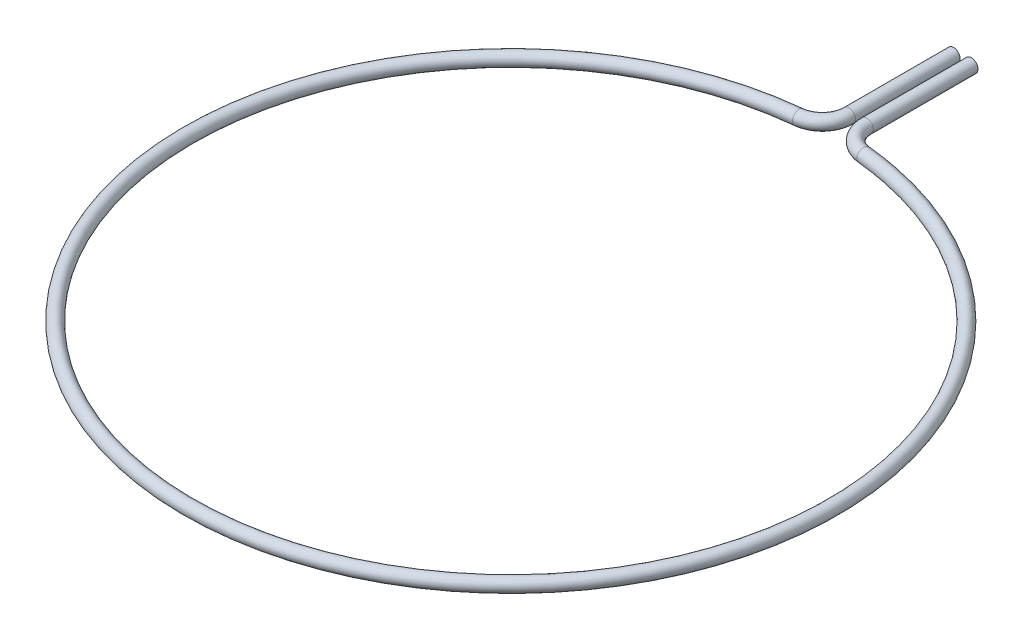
ISO-10303-21;
HEADER;
FILE_DESCRIPTION(('STEP AP214'),'2;1');
FILE_NAME('part.step','',(''),(''),'','','');
FILE_SCHEMA(('AUTOMOTIVE_DESIGN { 1 0 10303 214 1 1 1 1 }'));
ENDSEC;
DATA;
#1=APPLICATION_CONTEXT('core data for automotive mechanical design processes');
#2=APPLICATION_PROTOCOL_DEFINITION('international standard','automotive_design',2000,#1);
#3=PRODUCT_CONTEXT('',#1,'mechanical');
#4=PRODUCT('Part','Part','',(#3));
#5=PRODUCT_RELATED_PRODUCT_CATEGORY('part','',(#4));
#6=PRODUCT_DEFINITION_FORMATION('','',#4);
#7=PRODUCT_DEFINITION_CONTEXT('part definition',#1,'design');
#8=PRODUCT_DEFINITION('design','',#6,#7);
#9=PRODUCT_DEFINITION_SHAPE('','',#8);
#10=(LENGTH_UNIT() NAMED_UNIT(*) SI_UNIT(.MILLI.,.METRE.));
#11=(NAMED_UNIT(*) PLANE_ANGLE_UNIT() SI_UNIT($,.RADIAN.));
#12=(NAMED_UNIT(*) SI_UNIT($,.STERADIAN.) SOLID_ANGLE_UNIT());
#13=UNCERTAINTY_MEASURE_WITH_UNIT(LENGTH_MEASURE(1.E-05),#10,'distance_accuracy_value','');
#14=(GEOMETRIC_REPRESENTATION_CONTEXT(3) GLOBAL_UNCERTAINTY_ASSIGNED_CONTEXT((#13)) GLOBAL_UNIT_ASSIGNED_CONTEXT((#10,
#11,#12)) REPRESENTATION_CONTEXT('',''));
#15=CARTESIAN_POINT('',(0.,0.,0.));
#16=DIRECTION('',(0.,0.,1.));
#17=DIRECTION('',(1.,0.,0.));
#18=AXIS2_PLACEMENT_3D('',#15,#16,#17);
#19=CARTESIAN_POINT('',(-4.00000000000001,0.,-203.397366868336));
#20=DIRECTION('',(0.,0.,-1.));
#21=DIRECTION('',(-1.,0.,0.));
#22=AXIS2_PLACEMENT_3D('',#19,#20,#21);
#23=PLANE('',#22);
#24=CARTESIAN_POINT('',(-4.00000000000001,0.,-203.397366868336));
#25=DIRECTION('',(0.,0.,-1.));
#26=DIRECTION('',(-1.,0.,0.));
#27=AXIS2_PLACEMENT_3D('',#24,#25,#26);
#28=CIRCLE('',#27,3.);
#29=CARTESIAN_POINT('',(-7.00000000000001,0.,-203.397366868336));
#30=VERTEX_POINT('',#29);
#31=EDGE_CURVE('E64',#30,#30,#28,.T.);
#32=ORIENTED_EDGE('',*,*,#31,.T.);
#33=EDGE_LOOP('',(#32));
#34=FACE_BOUND('',#33,.T.);
#35=ADVANCED_FACE('F37',(#34),#23,.T.);
#36=CARTESIAN_POINT('',(3.99999999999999,0.,-203.397366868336));
#37=DIRECTION('',(0.,0.,1.));
#38=DIRECTION('',(1.,0.,0.));
#39=AXIS2_PLACEMENT_3D('',#36,#37,#38);
#40=PLANE('',#39);
#41=CARTESIAN_POINT('',(3.99999999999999,0.,-203.397366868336));
#42=DIRECTION('',(0.,0.,1.));
#43=DIRECTION('',(1.,0.,0.));
#44=AXIS2_PLACEMENT_3D('',#41,#42,#43);
#45=CIRCLE('',#44,3.);
#46=CARTESIAN_POINT('',(6.99999999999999,0.,-203.397366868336));
#47=VERTEX_POINT('',#46);
#48=EDGE_CURVE('E10',#47,#47,#45,.T.);
#49=ORIENTED_EDGE('',*,*,#48,.F.);
#50=EDGE_LOOP('',(#49));
#51=FACE_BOUND('',#50,.T.);
#52=ADVANCED_FACE('F73',(#51),#40,.F.);
#53=CARTESIAN_POINT('',(-4.00000000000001,0.,-203.397366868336));
#54=DIRECTION('',(0.,0.,1.));
#55=DIRECTION('',(1.,0.,0.));
#56=AXIS2_PLACEMENT_3D('',#53,#54,#55);
#57=CYLINDRICAL_SURFACE('',#56,3.);
#58=CARTESIAN_POINT('',(-4.,0.,-156.283108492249));
#59=DIRECTION('',(0.,0.,-1.));
#60=DIRECTION('',(-1.,0.,0.));
#61=AXIS2_PLACEMENT_3D('',#58,#59,#60);
#62=CIRCLE('',#61,3.);
#63=CARTESIAN_POINT('',(-1.,0.,-156.283108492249));
#64=VERTEX_POINT('',#63);
#65=EDGE_CURVE('E60',#64,#64,#62,.T.);
#66=ORIENTED_EDGE('',*,*,#65,.T.);
#67=EDGE_LOOP('',(#66));
#68=FACE_BOUND('',#67,.T.);
#69=ORIENTED_EDGE('',*,*,#31,.F.);
#70=EDGE_LOOP('',(#69));
#71=FACE_BOUND('',#70,.T.);
#72=ADVANCED_FACE('F70',(#68,#71),#57,.T.);
#73=CARTESIAN_POINT('',(-16.,0.,-156.283108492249));
#74=DIRECTION('',(0.,-1.,0.));
#75=DIRECTION('',(0.,0.,-1.));
#76=AXIS2_PLACEMENT_3D('',#73,#74,#75);
#77=TOROIDAL_SURFACE('',#76,12.,3.);
#78=CARTESIAN_POINT('',(-14.7778485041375,0.,-144.345506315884));
#79=DIRECTION('',(0.994800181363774,0.,-0.101845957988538));
#80=DIRECTION('',(-0.101845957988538,0.,-0.994800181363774));
#81=AXIS2_PLACEMENT_3D('',#78,#79,#80);
#82=CIRCLE('',#81,3.);
#83=CARTESIAN_POINT('',(-14.4723106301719,0.,-141.361105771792));
#84=VERTEX_POINT('',#83);
#85=EDGE_CURVE('E54',#84,#84,#82,.T.);
#86=CARTESIAN_POINT('',(-16.,0.,-156.283108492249));
#87=DIRECTION('',(0.,-1.,0.));
#88=DIRECTION('',(0.,0.,-1.));
#89=AXIS2_PLACEMENT_3D('',#86,#87,#88);
#90=CIRCLE('',#89,15.);
#91=EDGE_CURVE('',#64,#84,#90,.T.);
#92=ORIENTED_EDGE('',*,*,#65,.F.);
#93=ORIENTED_EDGE('',*,*,#85,.T.);
#94=ORIENTED_EDGE('',*,*,#91,.T.);
#95=ORIENTED_EDGE('',*,*,#91,.F.);
#96=EDGE_LOOP('',(#92,#94,#93,#95));
#97=FACE_BOUND('',#96,.T.);
#98=ADVANCED_FACE('F72',(#97),#77,.T.);
#99=CARTESIAN_POINT('',(0.,0.,0.));
#100=DIRECTION('',(0.,1.,0.));
#101=DIRECTION('',(0.,0.,1.));
#102=AXIS2_PLACEMENT_3D('',#99,#100,#101);
#103=TOROIDAL_SURFACE('',#102,145.1,3.);
#104=CARTESIAN_POINT('',(14.7778485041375,0.,-144.345506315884));
#105=DIRECTION('',(0.994800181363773,0.,0.101845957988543));
#106=DIRECTION('',(0.101845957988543,0.,-0.994800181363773));
#107=AXIS2_PLACEMENT_3D('',#104,#105,#106);
#108=CIRCLE('',#107,3.);
#109=CARTESIAN_POINT('',(14.4723106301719,0.,-141.361105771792));
#110=VERTEX_POINT('',#109);
#111=EDGE_CURVE('E49',#110,#110,#108,.T.);
#112=ORIENTED_EDGE('',*,*,#111,.T.);
#113=EDGE_LOOP('',(#112));
#114=FACE_BOUND('',#113,.T.);
#115=ORIENTED_EDGE('',*,*,#85,.F.);
#116=EDGE_LOOP('',(#115));
#117=FACE_BOUND('',#116,.T.);
#118=ADVANCED_FACE('F80',(#114,#117),#103,.T.);
#119=CARTESIAN_POINT('',(16.,0.,-156.283108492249));
#120=DIRECTION('',(0.,-1.,0.));
#121=DIRECTION('',(0.,0.,-1.));
#122=AXIS2_PLACEMENT_3D('',#119,#120,#121);
#123=TOROIDAL_SURFACE('',#122,12.,3.);
#124=CARTESIAN_POINT('',(3.99999999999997,0.,-156.283108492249));
#125=DIRECTION('',(0.,0.,1.));
#126=DIRECTION('',(1.,0.,0.));
#127=AXIS2_PLACEMENT_3D('',#124,#125,#126);
#128=CIRCLE('',#127,3.);
#129=CARTESIAN_POINT('',(1.,0.,-156.283108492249));
#130=VERTEX_POINT('',#129);
#131=EDGE_CURVE('E44',#130,#130,#128,.T.);
#132=CARTESIAN_POINT('',(16.,0.,-156.283108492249));
#133=DIRECTION('',(0.,-1.,0.));
#134=DIRECTION('',(0.,0.,-1.));
#135=AXIS2_PLACEMENT_3D('',#132,#133,#134);
#136=CIRCLE('',#135,15.);
#137=EDGE_CURVE('',#110,#130,#136,.T.);
#138=ORIENTED_EDGE('',*,*,#111,.F.);
#139=ORIENTED_EDGE('',*,*,#131,.T.);
#140=ORIENTED_EDGE('',*,*,#137,.T.);
#141=ORIENTED_EDGE('',*,*,#137,.F.);
#142=EDGE_LOOP('',(#138,#140,#139,#141));
#143=FACE_BOUND('',#142,.T.);
#144=ADVANCED_FACE('F86',(#143),#123,.T.);
#145=CARTESIAN_POINT('',(4.,0.,-156.283108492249));
#146=DIRECTION('',(0.,0.,-1.));
#147=DIRECTION('',(-1.,0.,0.));
#148=AXIS2_PLACEMENT_3D('',#145,#146,#147);
#149=CYLINDRICAL_SURFACE('',#148,3.);
#150=ORIENTED_EDGE('',*,*,#48,.T.);
#151=EDGE_LOOP('',(#150));
#152=FACE_BOUND('',#151,.T.);
#153=ORIENTED_EDGE('',*,*,#131,.F.);
#154=EDGE_LOOP('',(#153));
#155=FACE_BOUND('',#154,.T.);
#156=ADVANCED_FACE('F84',(#152,#155),#149,.T.);
#157=CLOSED_SHELL('',(#35,#52,#72,#98,#118,#144,#156));
#158=MANIFOLD_SOLID_BREP('B2',#157);
#159=ADVANCED_BREP_SHAPE_REPRESENTATION('',(#18,#158),#14);
#160=SHAPE_DEFINITION_REPRESENTATION(#9,#159);
ENDSEC;
END-ISO-10303-21;
